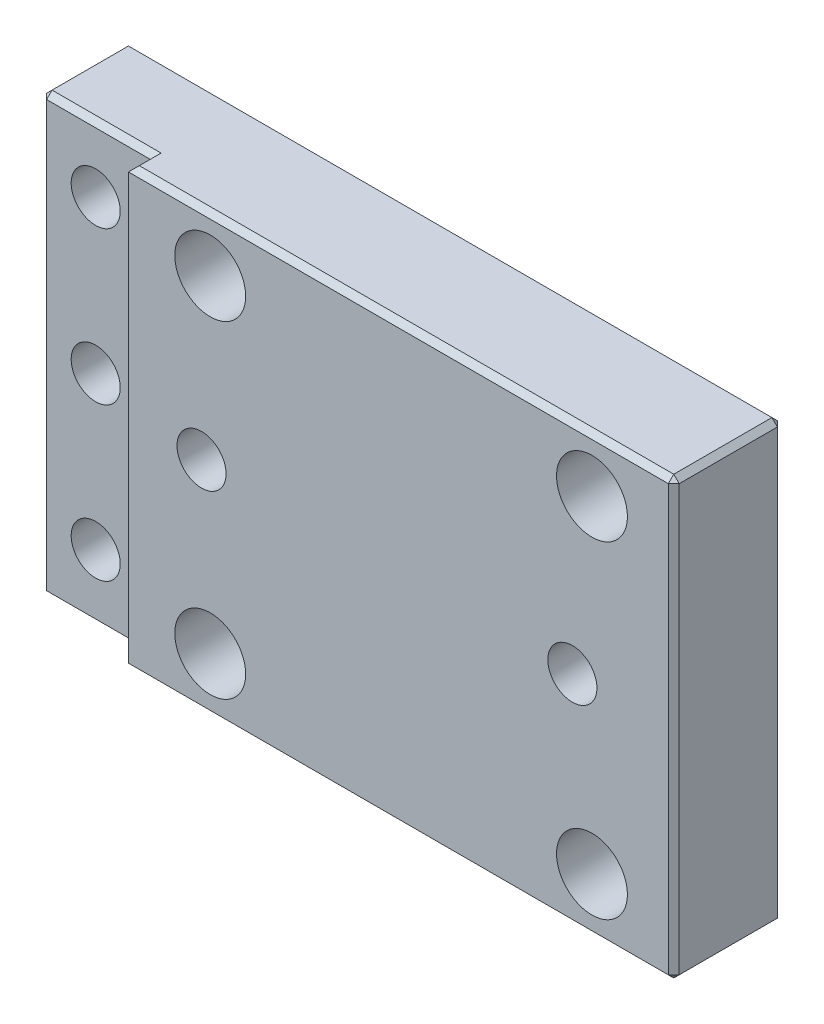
ISO-10303-21;
HEADER;
FILE_DESCRIPTION(('STEP AP214'),'2;1');
FILE_NAME('part.step','',(''),(''),'','','');
FILE_SCHEMA(('AUTOMOTIVE_DESIGN { 1 0 10303 214 1 1 1 1 }'));
ENDSEC;
DATA;
#1=APPLICATION_CONTEXT('core data for automotive mechanical design processes');
#2=APPLICATION_PROTOCOL_DEFINITION('international standard','automotive_design',2000,#1);
#3=PRODUCT_CONTEXT('',#1,'mechanical');
#4=PRODUCT('Part','Part','',(#3));
#5=PRODUCT_RELATED_PRODUCT_CATEGORY('part','',(#4));
#6=PRODUCT_DEFINITION_FORMATION('','',#4);
#7=PRODUCT_DEFINITION_CONTEXT('part definition',#1,'design');
#8=PRODUCT_DEFINITION('design','',#6,#7);
#9=PRODUCT_DEFINITION_SHAPE('','',#8);
#10=(LENGTH_UNIT() NAMED_UNIT(*) SI_UNIT(.MILLI.,.METRE.));
#11=(NAMED_UNIT(*) PLANE_ANGLE_UNIT() SI_UNIT($,.RADIAN.));
#12=(NAMED_UNIT(*) SI_UNIT($,.STERADIAN.) SOLID_ANGLE_UNIT());
#13=UNCERTAINTY_MEASURE_WITH_UNIT(LENGTH_MEASURE(1.E-05),#10,'distance_accuracy_value','');
#14=(GEOMETRIC_REPRESENTATION_CONTEXT(3) GLOBAL_UNCERTAINTY_ASSIGNED_CONTEXT((#13)) GLOBAL_UNIT_ASSIGNED_CONTEXT((#10,
#11,#12)) REPRESENTATION_CONTEXT('',''));
#15=CARTESIAN_POINT('',(0.,0.,0.));
#16=DIRECTION('',(0.,0.,1.));
#17=DIRECTION('',(1.,0.,0.));
#18=AXIS2_PLACEMENT_3D('',#15,#16,#17);
#19=CARTESIAN_POINT('',(30.,20.,10.));
#20=DIRECTION('',(-1.,0.,0.));
#21=DIRECTION('',(0.,-1.,0.));
#22=AXIS2_PLACEMENT_3D('',#19,#20,#21);
#23=PLANE('',#22);
#24=DIRECTION('',(0.,-1.,0.));
#25=VECTOR('',#24,1.);
#26=CARTESIAN_POINT('',(30.,-20.,9.5));
#27=LINE('',#26,#25);
#28=CARTESIAN_POINT('',(30.,19.5,9.5));
#29=VERTEX_POINT('',#28);
#30=CARTESIAN_POINT('',(30.,-19.5,9.5));
#31=VERTEX_POINT('',#30);
#32=EDGE_CURVE('E25',#29,#31,#27,.T.);
#33=ORIENTED_EDGE('',*,*,#32,.T.);
#34=DIRECTION('',(0.,0.,-1.));
#35=VECTOR('',#34,1.);
#36=CARTESIAN_POINT('',(30.,-19.5,10.));
#37=LINE('',#36,#35);
#38=CARTESIAN_POINT('',(30.,-19.5,0.500000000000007));
#39=VERTEX_POINT('',#38);
#40=EDGE_CURVE('E11',#31,#39,#37,.T.);
#41=ORIENTED_EDGE('',*,*,#40,.T.);
#42=DIRECTION('',(0.,1.,0.));
#43=VECTOR('',#42,1.);
#44=CARTESIAN_POINT('',(30.,20.,0.500000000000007));
#45=LINE('',#44,#43);
#46=CARTESIAN_POINT('',(30.,19.5,0.500000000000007));
#47=VERTEX_POINT('',#46);
#48=EDGE_CURVE('E224',#39,#47,#45,.T.);
#49=ORIENTED_EDGE('',*,*,#48,.T.);
#50=DIRECTION('',(0.,0.,1.));
#51=VECTOR('',#50,1.);
#52=CARTESIAN_POINT('',(30.,19.5,10.));
#53=LINE('',#52,#51);
#54=EDGE_CURVE('E36',#47,#29,#53,.T.);
#55=ORIENTED_EDGE('',*,*,#54,.T.);
#56=EDGE_LOOP('',(#33,#41,#49,#55));
#57=FACE_BOUND('',#56,.T.);
#58=ADVANCED_FACE('F16',(#57),#23,.F.);
#59=CARTESIAN_POINT('',(-30.,20.,10.));
#60=DIRECTION('',(0.,-1.,0.));
#61=DIRECTION('',(0.,0.,-1.));
#62=AXIS2_PLACEMENT_3D('',#59,#60,#61);
#63=PLANE('',#62);
#64=DIRECTION('',(-1.,0.,0.));
#65=VECTOR('',#64,1.);
#66=CARTESIAN_POINT('',(-30.,20.,0.500000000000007));
#67=LINE('',#66,#65);
#68=CARTESIAN_POINT('',(29.5,20.,0.500000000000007));
#69=VERTEX_POINT('',#68);
#70=CARTESIAN_POINT('',(-29.5,20.,0.500000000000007));
#71=VERTEX_POINT('',#70);
#72=EDGE_CURVE('E219',#69,#71,#67,.T.);
#73=ORIENTED_EDGE('',*,*,#72,.T.);
#74=DIRECTION('',(0.,0.,1.));
#75=VECTOR('',#74,1.);
#76=CARTESIAN_POINT('',(-29.5,20.,10.));
#77=LINE('',#76,#75);
#78=CARTESIAN_POINT('',(-29.5,20.,7.5));
#79=VERTEX_POINT('',#78);
#80=EDGE_CURVE('E221',#71,#79,#77,.T.);
#81=ORIENTED_EDGE('',*,*,#80,.T.);
#82=DIRECTION('',(1.,0.,0.));
#83=VECTOR('',#82,1.);
#84=CARTESIAN_POINT('',(-30.,20.,7.5));
#85=LINE('',#84,#83);
#86=CARTESIAN_POINT('',(-19.5,20.,7.5));
#87=VERTEX_POINT('',#86);
#88=EDGE_CURVE('E217',#79,#87,#85,.T.);
#89=ORIENTED_EDGE('',*,*,#88,.T.);
#90=DIRECTION('',(0.,0.,1.));
#91=VECTOR('',#90,1.);
#92=CARTESIAN_POINT('',(-19.5,20.,10.));
#93=LINE('',#92,#91);
#94=CARTESIAN_POINT('',(-19.5,20.,9.5));
#95=VERTEX_POINT('',#94);
#96=EDGE_CURVE('E157',#87,#95,#93,.T.);
#97=ORIENTED_EDGE('',*,*,#96,.T.);
#98=DIRECTION('',(1.,0.,0.));
#99=VECTOR('',#98,1.);
#100=CARTESIAN_POINT('',(30.,20.,9.5));
#101=LINE('',#100,#99);
#102=CARTESIAN_POINT('',(29.5,20.,9.5));
#103=VERTEX_POINT('',#102);
#104=EDGE_CURVE('E214',#95,#103,#101,.T.);
#105=ORIENTED_EDGE('',*,*,#104,.T.);
#106=DIRECTION('',(0.,0.,-1.));
#107=VECTOR('',#106,1.);
#108=CARTESIAN_POINT('',(29.5,20.,10.));
#109=LINE('',#108,#107);
#110=EDGE_CURVE('E212',#103,#69,#109,.T.);
#111=ORIENTED_EDGE('',*,*,#110,.T.);
#112=EDGE_LOOP('',(#73,#81,#89,#97,#105,#111));
#113=FACE_BOUND('',#112,.T.);
#114=ADVANCED_FACE('F410',(#113),#63,.F.);
#115=CARTESIAN_POINT('',(-30.,20.,10.));
#116=DIRECTION('',(1.,0.,0.));
#117=DIRECTION('',(0.,1.,0.));
#118=AXIS2_PLACEMENT_3D('',#115,#116,#117);
#119=PLANE('',#118);
#120=DIRECTION('',(0.,0.,-1.));
#121=VECTOR('',#120,1.);
#122=CARTESIAN_POINT('',(-30.,19.5,10.));
#123=LINE('',#122,#121);
#124=CARTESIAN_POINT('',(-30.,19.5,7.5));
#125=VERTEX_POINT('',#124);
#126=CARTESIAN_POINT('',(-30.,19.5,0.500000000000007));
#127=VERTEX_POINT('',#126);
#128=EDGE_CURVE('E203',#125,#127,#123,.T.);
#129=ORIENTED_EDGE('',*,*,#128,.T.);
#130=DIRECTION('',(0.,-1.,0.));
#131=VECTOR('',#130,1.);
#132=CARTESIAN_POINT('',(-30.,20.,0.500000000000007));
#133=LINE('',#132,#131);
#134=CARTESIAN_POINT('',(-30.,-19.5,0.500000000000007));
#135=VERTEX_POINT('',#134);
#136=EDGE_CURVE('E209',#127,#135,#133,.T.);
#137=ORIENTED_EDGE('',*,*,#136,.T.);
#138=DIRECTION('',(0.,0.,1.));
#139=VECTOR('',#138,1.);
#140=CARTESIAN_POINT('',(-30.,-19.5,10.));
#141=LINE('',#140,#139);
#142=CARTESIAN_POINT('',(-30.,-19.5,7.5));
#143=VERTEX_POINT('',#142);
#144=EDGE_CURVE('E207',#135,#143,#141,.T.);
#145=ORIENTED_EDGE('',*,*,#144,.T.);
#146=DIRECTION('',(0.,1.,0.));
#147=VECTOR('',#146,1.);
#148=CARTESIAN_POINT('',(-30.,20.,7.5));
#149=LINE('',#148,#147);
#150=EDGE_CURVE('E205',#143,#125,#149,.T.);
#151=ORIENTED_EDGE('',*,*,#150,.T.);
#152=EDGE_LOOP('',(#129,#137,#145,#151));
#153=FACE_BOUND('',#152,.T.);
#154=ADVANCED_FACE('F404',(#153),#119,.F.);
#155=CARTESIAN_POINT('',(-30.,-20.,10.));
#156=DIRECTION('',(0.,1.,0.));
#157=DIRECTION('',(0.,0.,1.));
#158=AXIS2_PLACEMENT_3D('',#155,#156,#157);
#159=PLANE('',#158);
#160=DIRECTION('',(-1.,0.,0.));
#161=VECTOR('',#160,1.);
#162=CARTESIAN_POINT('',(-30.,-20.,7.5));
#163=LINE('',#162,#161);
#164=CARTESIAN_POINT('',(-19.5,-20.,7.5));
#165=VERTEX_POINT('',#164);
#166=CARTESIAN_POINT('',(-29.5,-20.,7.5));
#167=VERTEX_POINT('',#166);
#168=EDGE_CURVE('E183',#165,#167,#163,.T.);
#169=ORIENTED_EDGE('',*,*,#168,.T.);
#170=DIRECTION('',(0.,0.,-1.));
#171=VECTOR('',#170,1.);
#172=CARTESIAN_POINT('',(-29.5,-20.,10.));
#173=LINE('',#172,#171);
#174=CARTESIAN_POINT('',(-29.5,-20.,0.500000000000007));
#175=VERTEX_POINT('',#174);
#176=EDGE_CURVE('E141',#167,#175,#173,.T.);
#177=ORIENTED_EDGE('',*,*,#176,.T.);
#178=DIRECTION('',(1.,0.,0.));
#179=VECTOR('',#178,1.);
#180=CARTESIAN_POINT('',(-30.,-20.,0.500000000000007));
#181=LINE('',#180,#179);
#182=CARTESIAN_POINT('',(29.5,-20.,0.500000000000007));
#183=VERTEX_POINT('',#182);
#184=EDGE_CURVE('E177',#175,#183,#181,.T.);
#185=ORIENTED_EDGE('',*,*,#184,.T.);
#186=DIRECTION('',(0.,0.,1.));
#187=VECTOR('',#186,1.);
#188=CARTESIAN_POINT('',(29.5,-20.,10.));
#189=LINE('',#188,#187);
#190=CARTESIAN_POINT('',(29.5,-20.,9.5));
#191=VERTEX_POINT('',#190);
#192=EDGE_CURVE('E175',#183,#191,#189,.T.);
#193=ORIENTED_EDGE('',*,*,#192,.T.);
#194=DIRECTION('',(-1.,0.,0.));
#195=VECTOR('',#194,1.);
#196=CARTESIAN_POINT('',(-20.,-20.,9.5));
#197=LINE('',#196,#195);
#198=CARTESIAN_POINT('',(-19.5,-20.,9.5));
#199=VERTEX_POINT('',#198);
#200=EDGE_CURVE('E179',#191,#199,#197,.T.);
#201=ORIENTED_EDGE('',*,*,#200,.T.);
#202=DIRECTION('',(0.,0.,-1.));
#203=VECTOR('',#202,1.);
#204=CARTESIAN_POINT('',(-19.5,-20.,10.));
#205=LINE('',#204,#203);
#206=EDGE_CURVE('E181',#199,#165,#205,.T.);
#207=ORIENTED_EDGE('',*,*,#206,.T.);
#208=EDGE_LOOP('',(#169,#177,#185,#193,#201,#207));
#209=FACE_BOUND('',#208,.T.);
#210=ADVANCED_FACE('F393',(#209),#159,.F.);
#211=CARTESIAN_POINT('',(0.,0.,10.));
#212=DIRECTION('',(0.,0.,1.));
#213=DIRECTION('',(1.,0.,0.));
#214=AXIS2_PLACEMENT_3D('',#211,#212,#213);
#215=PLANE('',#214);
#216=DIRECTION('',(0.,1.,0.));
#217=VECTOR('',#216,1.);
#218=CARTESIAN_POINT('',(-20.,0.,10.));
#219=LINE('',#218,#217);
#220=CARTESIAN_POINT('',(-20.,-19.5,10.));
#221=VERTEX_POINT('',#220);
#222=CARTESIAN_POINT('',(-20.,19.5,10.));
#223=VERTEX_POINT('',#222);
#224=EDGE_CURVE('E135',#221,#223,#219,.T.);
#225=ORIENTED_EDGE('',*,*,#224,.F.);
#226=DIRECTION('',(1.,0.,0.));
#227=VECTOR('',#226,1.);
#228=CARTESIAN_POINT('',(30.,-19.5,10.));
#229=LINE('',#228,#227);
#230=CARTESIAN_POINT('',(29.5,-19.5,10.));
#231=VERTEX_POINT('',#230);
#232=EDGE_CURVE('E192',#221,#231,#229,.T.);
#233=ORIENTED_EDGE('',*,*,#232,.T.);
#234=DIRECTION('',(0.,1.,0.));
#235=VECTOR('',#234,1.);
#236=CARTESIAN_POINT('',(29.5,20.,10.));
#237=LINE('',#236,#235);
#238=CARTESIAN_POINT('',(29.5,19.5,10.));
#239=VERTEX_POINT('',#238);
#240=EDGE_CURVE('E188',#231,#239,#237,.T.);
#241=ORIENTED_EDGE('',*,*,#240,.T.);
#242=DIRECTION('',(-1.,0.,0.));
#243=VECTOR('',#242,1.);
#244=CARTESIAN_POINT('',(-20.,19.5,10.));
#245=LINE('',#244,#243);
#246=EDGE_CURVE('E190',#239,#223,#245,.T.);
#247=ORIENTED_EDGE('',*,*,#246,.T.);
#248=EDGE_LOOP('',(#225,#233,#241,#247));
#249=FACE_BOUND('',#248,.T.);
#250=CARTESIAN_POINT('',(22.5,-15.,10.));
#251=DIRECTION('',(0.,0.,1.));
#252=DIRECTION('',(1.,0.,0.));
#253=AXIS2_PLACEMENT_3D('',#250,#251,#252);
#254=CIRCLE('',#253,3.25);
#255=CARTESIAN_POINT('',(25.75,-15.,10.));
#256=VERTEX_POINT('',#255);
#257=EDGE_CURVE('E300',#256,#256,#254,.T.);
#258=ORIENTED_EDGE('',*,*,#257,.F.);
#259=EDGE_LOOP('',(#258));
#260=FACE_BOUND('',#259,.T.);
#261=CARTESIAN_POINT('',(-12.5,-15.,10.));
#262=DIRECTION('',(0.,0.,1.));
#263=DIRECTION('',(1.,0.,0.));
#264=AXIS2_PLACEMENT_3D('',#261,#262,#263);
#265=CIRCLE('',#264,3.25);
#266=CARTESIAN_POINT('',(-9.25,-15.,10.));
#267=VERTEX_POINT('',#266);
#268=EDGE_CURVE('E311',#267,#267,#265,.T.);
#269=ORIENTED_EDGE('',*,*,#268,.F.);
#270=EDGE_LOOP('',(#269));
#271=FACE_BOUND('',#270,.T.);
#272=CARTESIAN_POINT('',(-12.5,15.,10.));
#273=DIRECTION('',(0.,0.,1.));
#274=DIRECTION('',(1.,0.,0.));
#275=AXIS2_PLACEMENT_3D('',#272,#273,#274);
#276=CIRCLE('',#275,3.25);
#277=CARTESIAN_POINT('',(-9.25,15.,10.));
#278=VERTEX_POINT('',#277);
#279=EDGE_CURVE('E319',#278,#278,#276,.T.);
#280=ORIENTED_EDGE('',*,*,#279,.F.);
#281=EDGE_LOOP('',(#280));
#282=FACE_BOUND('',#281,.T.);
#283=CARTESIAN_POINT('',(22.5,15.,10.));
#284=DIRECTION('',(0.,0.,1.));
#285=DIRECTION('',(1.,0.,0.));
#286=AXIS2_PLACEMENT_3D('',#283,#284,#285);
#287=CIRCLE('',#286,3.25);
#288=CARTESIAN_POINT('',(25.75,15.,10.));
#289=VERTEX_POINT('',#288);
#290=EDGE_CURVE('E325',#289,#289,#287,.T.);
#291=ORIENTED_EDGE('',*,*,#290,.F.);
#292=EDGE_LOOP('',(#291));
#293=FACE_BOUND('',#292,.T.);
#294=CARTESIAN_POINT('',(20.7036288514,0.,10.));
#295=DIRECTION('',(0.,0.,1.));
#296=DIRECTION('',(1.,0.,0.));
#297=AXIS2_PLACEMENT_3D('',#294,#295,#296);
#298=CIRCLE('',#297,2.25);
#299=CARTESIAN_POINT('',(22.9536288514,0.,10.));
#300=VERTEX_POINT('',#299);
#301=EDGE_CURVE('E171',#300,#300,#298,.T.);
#302=ORIENTED_EDGE('',*,*,#301,.F.);
#303=EDGE_LOOP('',(#302));
#304=FACE_BOUND('',#303,.T.);
#305=CARTESIAN_POINT('',(-13.2963711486,0.,10.));
#306=DIRECTION('',(0.,0.,1.));
#307=DIRECTION('',(1.,0.,0.));
#308=AXIS2_PLACEMENT_3D('',#305,#306,#307);
#309=CIRCLE('',#308,2.25);
#310=CARTESIAN_POINT('',(-11.0463711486,0.,10.));
#311=VERTEX_POINT('',#310);
#312=EDGE_CURVE('E349',#311,#311,#309,.T.);
#313=ORIENTED_EDGE('',*,*,#312,.F.);
#314=EDGE_LOOP('',(#313));
#315=FACE_BOUND('',#314,.T.);
#316=ADVANCED_FACE('F390',(#249,#260,#271,#282,#293,#304,#315),#215,.T.);
#317=CARTESIAN_POINT('',(0.,0.,0.));
#318=DIRECTION('',(0.,0.,1.));
#319=DIRECTION('',(1.,0.,0.));
#320=AXIS2_PLACEMENT_3D('',#317,#318,#319);
#321=PLANE('',#320);
#322=DIRECTION('',(0.,-1.,0.));
#323=VECTOR('',#322,1.);
#324=CARTESIAN_POINT('',(29.5,0.,0.));
#325=LINE('',#324,#323);
#326=CARTESIAN_POINT('',(29.5,19.5,0.));
#327=VERTEX_POINT('',#326);
#328=CARTESIAN_POINT('',(29.5,-19.5,0.));
#329=VERTEX_POINT('',#328);
#330=EDGE_CURVE('E194',#327,#329,#325,.T.);
#331=ORIENTED_EDGE('',*,*,#330,.T.);
#332=DIRECTION('',(-1.,0.,0.));
#333=VECTOR('',#332,1.);
#334=CARTESIAN_POINT('',(0.,-19.5,0.));
#335=LINE('',#334,#333);
#336=CARTESIAN_POINT('',(-29.5,-19.5,0.));
#337=VERTEX_POINT('',#336);
#338=EDGE_CURVE('E200',#329,#337,#335,.T.);
#339=ORIENTED_EDGE('',*,*,#338,.T.);
#340=DIRECTION('',(0.,1.,0.));
#341=VECTOR('',#340,1.);
#342=CARTESIAN_POINT('',(-29.5,0.,0.));
#343=LINE('',#342,#341);
#344=CARTESIAN_POINT('',(-29.5,19.5,0.));
#345=VERTEX_POINT('',#344);
#346=EDGE_CURVE('E198',#337,#345,#343,.T.);
#347=ORIENTED_EDGE('',*,*,#346,.T.);
#348=DIRECTION('',(1.,0.,0.));
#349=VECTOR('',#348,1.);
#350=CARTESIAN_POINT('',(0.,19.5,0.));
#351=LINE('',#350,#349);
#352=EDGE_CURVE('E196',#345,#327,#351,.T.);
#353=ORIENTED_EDGE('',*,*,#352,.T.);
#354=EDGE_LOOP('',(#331,#339,#347,#353));
#355=FACE_BOUND('',#354,.T.);
#356=CARTESIAN_POINT('',(22.5,-15.,0.));
#357=DIRECTION('',(0.,0.,1.));
#358=DIRECTION('',(1.,0.,0.));
#359=AXIS2_PLACEMENT_3D('',#356,#357,#358);
#360=CIRCLE('',#359,3.25);
#361=CARTESIAN_POINT('',(25.75,-15.,0.));
#362=VERTEX_POINT('',#361);
#363=EDGE_CURVE('E306',#362,#362,#360,.T.);
#364=ORIENTED_EDGE('',*,*,#363,.T.);
#365=EDGE_LOOP('',(#364));
#366=FACE_BOUND('',#365,.T.);
#367=CARTESIAN_POINT('',(-12.5,-15.,0.));
#368=DIRECTION('',(0.,0.,1.));
#369=DIRECTION('',(1.,0.,0.));
#370=AXIS2_PLACEMENT_3D('',#367,#368,#369);
#371=CIRCLE('',#370,3.25);
#372=CARTESIAN_POINT('',(-9.25,-15.,0.));
#373=VERTEX_POINT('',#372);
#374=EDGE_CURVE('E316',#373,#373,#371,.T.);
#375=ORIENTED_EDGE('',*,*,#374,.T.);
#376=EDGE_LOOP('',(#375));
#377=FACE_BOUND('',#376,.T.);
#378=CARTESIAN_POINT('',(-12.5,15.,0.));
#379=DIRECTION('',(0.,0.,1.));
#380=DIRECTION('',(1.,0.,0.));
#381=AXIS2_PLACEMENT_3D('',#378,#379,#380);
#382=CIRCLE('',#381,3.25);
#383=CARTESIAN_POINT('',(-9.25,15.,0.));
#384=VERTEX_POINT('',#383);
#385=EDGE_CURVE('E322',#384,#384,#382,.T.);
#386=ORIENTED_EDGE('',*,*,#385,.T.);
#387=EDGE_LOOP('',(#386));
#388=FACE_BOUND('',#387,.T.);
#389=CARTESIAN_POINT('',(22.5,15.,0.));
#390=DIRECTION('',(0.,0.,1.));
#391=DIRECTION('',(1.,0.,0.));
#392=AXIS2_PLACEMENT_3D('',#389,#390,#391);
#393=CIRCLE('',#392,3.25);
#394=CARTESIAN_POINT('',(25.75,15.,0.));
#395=VERTEX_POINT('',#394);
#396=EDGE_CURVE('E328',#395,#395,#393,.T.);
#397=ORIENTED_EDGE('',*,*,#396,.T.);
#398=EDGE_LOOP('',(#397));
#399=FACE_BOUND('',#398,.T.);
#400=CARTESIAN_POINT('',(20.7036288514,0.,0.));
#401=DIRECTION('',(0.,0.,-1.));
#402=DIRECTION('',(-1.,0.,0.));
#403=AXIS2_PLACEMENT_3D('',#400,#401,#402);
#404=CIRCLE('',#403,4.);
#405=CARTESIAN_POINT('',(16.7036288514,0.,0.));
#406=VERTEX_POINT('',#405);
#407=EDGE_CURVE('E331',#406,#406,#404,.T.);
#408=ORIENTED_EDGE('',*,*,#407,.F.);
#409=EDGE_LOOP('',(#408));
#410=FACE_BOUND('',#409,.T.);
#411=CARTESIAN_POINT('',(-13.2963711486,0.,0.));
#412=DIRECTION('',(0.,0.,-1.));
#413=DIRECTION('',(-1.,0.,0.));
#414=AXIS2_PLACEMENT_3D('',#411,#412,#413);
#415=CIRCLE('',#414,4.);
#416=CARTESIAN_POINT('',(-17.2963711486,0.,0.));
#417=VERTEX_POINT('',#416);
#418=EDGE_CURVE('E340',#417,#417,#415,.T.);
#419=ORIENTED_EDGE('',*,*,#418,.F.);
#420=EDGE_LOOP('',(#419));
#421=FACE_BOUND('',#420,.T.);
#422=CARTESIAN_POINT('',(-25.,14.,0.));
#423=DIRECTION('',(0.,0.,-1.));
#424=DIRECTION('',(-1.,0.,0.));
#425=AXIS2_PLACEMENT_3D('',#422,#423,#424);
#426=CIRCLE('',#425,4.);
#427=CARTESIAN_POINT('',(-29.,14.,0.));
#428=VERTEX_POINT('',#427);
#429=EDGE_CURVE('E350',#428,#428,#426,.T.);
#430=ORIENTED_EDGE('',*,*,#429,.F.);
#431=EDGE_LOOP('',(#430));
#432=FACE_BOUND('',#431,.T.);
#433=CARTESIAN_POINT('',(-25.,0.,0.));
#434=DIRECTION('',(0.,0.,-1.));
#435=DIRECTION('',(-1.,0.,0.));
#436=AXIS2_PLACEMENT_3D('',#433,#434,#435);
#437=CIRCLE('',#436,4.);
#438=CARTESIAN_POINT('',(-29.,0.,0.));
#439=VERTEX_POINT('',#438);
#440=EDGE_CURVE('E360',#439,#439,#437,.T.);
#441=ORIENTED_EDGE('',*,*,#440,.F.);
#442=EDGE_LOOP('',(#441));
#443=FACE_BOUND('',#442,.T.);
#444=CARTESIAN_POINT('',(-25.,-14.,0.));
#445=DIRECTION('',(0.,0.,-1.));
#446=DIRECTION('',(-1.,0.,0.));
#447=AXIS2_PLACEMENT_3D('',#444,#445,#446);
#448=CIRCLE('',#447,4.);
#449=CARTESIAN_POINT('',(-29.,-14.,0.));
#450=VERTEX_POINT('',#449);
#451=EDGE_CURVE('E370',#450,#450,#448,.T.);
#452=ORIENTED_EDGE('',*,*,#451,.F.);
#453=EDGE_LOOP('',(#452));
#454=FACE_BOUND('',#453,.T.);
#455=ADVANCED_FACE('F392',(#355,#366,#377,#388,#399,#410,#421,#432,#443,#454),#321,.F.);
#456=CARTESIAN_POINT('',(-20.,20.,8.));
#457=DIRECTION('',(0.,0.,-1.));
#458=DIRECTION('',(-1.,0.,0.));
#459=AXIS2_PLACEMENT_3D('',#456,#457,#458);
#460=PLANE('',#459);
#461=CARTESIAN_POINT('',(-25.,14.,8.));
#462=DIRECTION('',(0.,0.,-1.));
#463=DIRECTION('',(-1.,0.,0.));
#464=AXIS2_PLACEMENT_3D('',#461,#462,#463);
#465=CIRCLE('',#464,2.25);
#466=CARTESIAN_POINT('',(-27.25,14.,8.));
#467=VERTEX_POINT('',#466);
#468=EDGE_CURVE('E359',#467,#467,#465,.T.);
#469=ORIENTED_EDGE('',*,*,#468,.T.);
#470=EDGE_LOOP('',(#469));
#471=FACE_BOUND('',#470,.T.);
#472=CARTESIAN_POINT('',(-25.,0.,8.));
#473=DIRECTION('',(0.,0.,-1.));
#474=DIRECTION('',(-1.,0.,0.));
#475=AXIS2_PLACEMENT_3D('',#472,#473,#474);
#476=CIRCLE('',#475,2.25);
#477=CARTESIAN_POINT('',(-27.25,0.,8.));
#478=VERTEX_POINT('',#477);
#479=EDGE_CURVE('E369',#478,#478,#476,.T.);
#480=ORIENTED_EDGE('',*,*,#479,.T.);
#481=EDGE_LOOP('',(#480));
#482=FACE_BOUND('',#481,.T.);
#483=CARTESIAN_POINT('',(-25.,-14.,8.));
#484=DIRECTION('',(0.,0.,-1.));
#485=DIRECTION('',(-1.,0.,0.));
#486=AXIS2_PLACEMENT_3D('',#483,#484,#485);
#487=CIRCLE('',#486,2.25);
#488=CARTESIAN_POINT('',(-27.25,-14.,8.));
#489=VERTEX_POINT('',#488);
#490=EDGE_CURVE('E151',#489,#489,#487,.T.);
#491=ORIENTED_EDGE('',*,*,#490,.T.);
#492=EDGE_LOOP('',(#491));
#493=FACE_BOUND('',#492,.T.);
#494=DIRECTION('',(0.,-1.,0.));
#495=VECTOR('',#494,1.);
#496=CARTESIAN_POINT('',(-29.5,20.,8.));
#497=LINE('',#496,#495);
#498=CARTESIAN_POINT('',(-29.5,19.5,8.));
#499=VERTEX_POINT('',#498);
#500=CARTESIAN_POINT('',(-29.5,-19.5,8.));
#501=VERTEX_POINT('',#500);
#502=EDGE_CURVE('E166',#499,#501,#497,.T.);
#503=ORIENTED_EDGE('',*,*,#502,.T.);
#504=DIRECTION('',(1.,0.,0.));
#505=VECTOR('',#504,1.);
#506=CARTESIAN_POINT('',(-20.,-19.5,8.));
#507=LINE('',#506,#505);
#508=CARTESIAN_POINT('',(-20.,-19.5,8.));
#509=VERTEX_POINT('',#508);
#510=EDGE_CURVE('E150',#501,#509,#507,.T.);
#511=ORIENTED_EDGE('',*,*,#510,.T.);
#512=DIRECTION('',(0.,-1.,0.));
#513=VECTOR('',#512,1.);
#514=CARTESIAN_POINT('',(-20.,20.,8.));
#515=LINE('',#514,#513);
#516=CARTESIAN_POINT('',(-20.,19.5,8.));
#517=VERTEX_POINT('',#516);
#518=EDGE_CURVE('E133',#517,#509,#515,.T.);
#519=ORIENTED_EDGE('',*,*,#518,.F.);
#520=DIRECTION('',(-1.,0.,0.));
#521=VECTOR('',#520,1.);
#522=CARTESIAN_POINT('',(-20.,19.5,8.));
#523=LINE('',#522,#521);
#524=EDGE_CURVE('E147',#517,#499,#523,.T.);
#525=ORIENTED_EDGE('',*,*,#524,.T.);
#526=EDGE_LOOP('',(#503,#511,#519,#525));
#527=FACE_BOUND('',#526,.T.);
#528=ADVANCED_FACE('F145',(#471,#482,#493,#527),#460,.F.);
#529=CARTESIAN_POINT('',(-20.,20.,8.));
#530=DIRECTION('',(1.,0.,0.));
#531=DIRECTION('',(0.,0.,-1.));
#532=AXIS2_PLACEMENT_3D('',#529,#530,#531);
#533=PLANE('',#532);
#534=ORIENTED_EDGE('',*,*,#518,.T.);
#535=DIRECTION('',(0.,0.,1.));
#536=VECTOR('',#535,1.);
#537=CARTESIAN_POINT('',(-20.,-19.5,8.));
#538=LINE('',#537,#536);
#539=EDGE_CURVE('E140',#509,#221,#538,.T.);
#540=ORIENTED_EDGE('',*,*,#539,.T.);
#541=ORIENTED_EDGE('',*,*,#224,.T.);
#542=DIRECTION('',(0.,0.,-1.));
#543=VECTOR('',#542,1.);
#544=CARTESIAN_POINT('',(-20.,19.5,8.));
#545=LINE('',#544,#543);
#546=EDGE_CURVE('E130',#223,#517,#545,.T.);
#547=ORIENTED_EDGE('',*,*,#546,.T.);
#548=EDGE_LOOP('',(#534,#540,#541,#547));
#549=FACE_BOUND('',#548,.T.);
#550=ADVANCED_FACE('F132',(#549),#533,.F.);
#551=CARTESIAN_POINT('',(-25.,-14.,0.));
#552=DIRECTION('',(0.,0.,-1.));
#553=DIRECTION('',(-1.,0.,0.));
#554=AXIS2_PLACEMENT_3D('',#551,#552,#553);
#555=CYLINDRICAL_SURFACE('',#554,2.25);
#556=CARTESIAN_POINT('',(-25.,-14.,4.4));
#557=DIRECTION('',(0.,0.,-1.));
#558=DIRECTION('',(-1.,0.,0.));
#559=AXIS2_PLACEMENT_3D('',#556,#557,#558);
#560=CIRCLE('',#559,2.25);
#561=CARTESIAN_POINT('',(-27.25,-14.,4.4));
#562=VERTEX_POINT('',#561);
#563=EDGE_CURVE('E376',#562,#562,#560,.T.);
#564=ORIENTED_EDGE('',*,*,#563,.T.);
#565=EDGE_LOOP('',(#564));
#566=FACE_BOUND('',#565,.T.);
#567=ORIENTED_EDGE('',*,*,#490,.F.);
#568=EDGE_LOOP('',(#567));
#569=FACE_BOUND('',#568,.T.);
#570=ADVANCED_FACE('F603',(#566,#569),#555,.F.);
#571=CARTESIAN_POINT('',(-22.75,-14.,4.4));
#572=DIRECTION('',(0.,0.,1.));
#573=DIRECTION('',(1.,0.,0.));
#574=AXIS2_PLACEMENT_3D('',#571,#572,#573);
#575=PLANE('',#574);
#576=ORIENTED_EDGE('',*,*,#563,.F.);
#577=EDGE_LOOP('',(#576));
#578=FACE_BOUND('',#577,.T.);
#579=CARTESIAN_POINT('',(-25.,-14.,4.4));
#580=DIRECTION('',(0.,0.,-1.));
#581=DIRECTION('',(-1.,0.,0.));
#582=AXIS2_PLACEMENT_3D('',#579,#580,#581);
#583=CIRCLE('',#582,4.);
#584=CARTESIAN_POINT('',(-29.,-14.,4.4));
#585=VERTEX_POINT('',#584);
#586=EDGE_CURVE('E373',#585,#585,#583,.T.);
#587=ORIENTED_EDGE('',*,*,#586,.T.);
#588=EDGE_LOOP('',(#587));
#589=FACE_BOUND('',#588,.T.);
#590=ADVANCED_FACE('F612',(#578,#589),#575,.F.);
#591=CARTESIAN_POINT('',(-25.,-14.,0.));
#592=DIRECTION('',(0.,0.,-1.));
#593=DIRECTION('',(-1.,0.,0.));
#594=AXIS2_PLACEMENT_3D('',#591,#592,#593);
#595=CYLINDRICAL_SURFACE('',#594,4.);
#596=ORIENTED_EDGE('',*,*,#586,.F.);
#597=EDGE_LOOP('',(#596));
#598=FACE_BOUND('',#597,.T.);
#599=ORIENTED_EDGE('',*,*,#451,.T.);
#600=EDGE_LOOP('',(#599));
#601=FACE_BOUND('',#600,.T.);
#602=ADVANCED_FACE('F622',(#598,#601),#595,.F.);
#603=CARTESIAN_POINT('',(-25.,0.,0.));
#604=DIRECTION('',(0.,0.,-1.));
#605=DIRECTION('',(-1.,0.,0.));
#606=AXIS2_PLACEMENT_3D('',#603,#604,#605);
#607=CYLINDRICAL_SURFACE('',#606,2.25);
#608=CARTESIAN_POINT('',(-25.,0.,4.4));
#609=DIRECTION('',(0.,0.,-1.));
#610=DIRECTION('',(-1.,0.,0.));
#611=AXIS2_PLACEMENT_3D('',#608,#609,#610);
#612=CIRCLE('',#611,2.25);
#613=CARTESIAN_POINT('',(-27.25,0.,4.4));
#614=VERTEX_POINT('',#613);
#615=EDGE_CURVE('E366',#614,#614,#612,.T.);
#616=ORIENTED_EDGE('',*,*,#615,.T.);
#617=EDGE_LOOP('',(#616));
#618=FACE_BOUND('',#617,.T.);
#619=ORIENTED_EDGE('',*,*,#479,.F.);
#620=EDGE_LOOP('',(#619));
#621=FACE_BOUND('',#620,.T.);
#622=ADVANCED_FACE('F632',(#618,#621),#607,.F.);
#623=CARTESIAN_POINT('',(-22.75,0.,4.4));
#624=DIRECTION('',(0.,0.,1.));
#625=DIRECTION('',(1.,0.,0.));
#626=AXIS2_PLACEMENT_3D('',#623,#624,#625);
#627=PLANE('',#626);
#628=ORIENTED_EDGE('',*,*,#615,.F.);
#629=EDGE_LOOP('',(#628));
#630=FACE_BOUND('',#629,.T.);
#631=CARTESIAN_POINT('',(-25.,0.,4.4));
#632=DIRECTION('',(0.,0.,-1.));
#633=DIRECTION('',(-1.,0.,0.));
#634=AXIS2_PLACEMENT_3D('',#631,#632,#633);
#635=CIRCLE('',#634,4.);
#636=CARTESIAN_POINT('',(-29.,0.,4.4));
#637=VERTEX_POINT('',#636);
#638=EDGE_CURVE('E363',#637,#637,#635,.T.);
#639=ORIENTED_EDGE('',*,*,#638,.T.);
#640=EDGE_LOOP('',(#639));
#641=FACE_BOUND('',#640,.T.);
#642=ADVANCED_FACE('F642',(#630,#641),#627,.F.);
#643=CARTESIAN_POINT('',(-25.,0.,0.));
#644=DIRECTION('',(0.,0.,-1.));
#645=DIRECTION('',(-1.,0.,0.));
#646=AXIS2_PLACEMENT_3D('',#643,#644,#645);
#647=CYLINDRICAL_SURFACE('',#646,4.);
#648=ORIENTED_EDGE('',*,*,#638,.F.);
#649=EDGE_LOOP('',(#648));
#650=FACE_BOUND('',#649,.T.);
#651=ORIENTED_EDGE('',*,*,#440,.T.);
#652=EDGE_LOOP('',(#651));
#653=FACE_BOUND('',#652,.T.);
#654=ADVANCED_FACE('F652',(#650,#653),#647,.F.);
#655=CARTESIAN_POINT('',(-25.,14.,0.));
#656=DIRECTION('',(0.,0.,-1.));
#657=DIRECTION('',(-1.,0.,0.));
#658=AXIS2_PLACEMENT_3D('',#655,#656,#657);
#659=CYLINDRICAL_SURFACE('',#658,2.25);
#660=CARTESIAN_POINT('',(-25.,14.,4.4));
#661=DIRECTION('',(0.,0.,-1.));
#662=DIRECTION('',(-1.,0.,0.));
#663=AXIS2_PLACEMENT_3D('',#660,#661,#662);
#664=CIRCLE('',#663,2.25);
#665=CARTESIAN_POINT('',(-27.25,14.,4.4));
#666=VERTEX_POINT('',#665);
#667=EDGE_CURVE('E356',#666,#666,#664,.T.);
#668=ORIENTED_EDGE('',*,*,#667,.T.);
#669=EDGE_LOOP('',(#668));
#670=FACE_BOUND('',#669,.T.);
#671=ORIENTED_EDGE('',*,*,#468,.F.);
#672=EDGE_LOOP('',(#671));
#673=FACE_BOUND('',#672,.T.);
#674=ADVANCED_FACE('F662',(#670,#673),#659,.F.);
#675=CARTESIAN_POINT('',(-22.75,14.,4.4));
#676=DIRECTION('',(0.,0.,1.));
#677=DIRECTION('',(1.,0.,0.));
#678=AXIS2_PLACEMENT_3D('',#675,#676,#677);
#679=PLANE('',#678);
#680=ORIENTED_EDGE('',*,*,#667,.F.);
#681=EDGE_LOOP('',(#680));
#682=FACE_BOUND('',#681,.T.);
#683=CARTESIAN_POINT('',(-25.,14.,4.4));
#684=DIRECTION('',(0.,0.,-1.));
#685=DIRECTION('',(-1.,0.,0.));
#686=AXIS2_PLACEMENT_3D('',#683,#684,#685);
#687=CIRCLE('',#686,4.);
#688=CARTESIAN_POINT('',(-29.,14.,4.4));
#689=VERTEX_POINT('',#688);
#690=EDGE_CURVE('E353',#689,#689,#687,.T.);
#691=ORIENTED_EDGE('',*,*,#690,.T.);
#692=EDGE_LOOP('',(#691));
#693=FACE_BOUND('',#692,.T.);
#694=ADVANCED_FACE('F672',(#682,#693),#679,.F.);
#695=CARTESIAN_POINT('',(-25.,14.,0.));
#696=DIRECTION('',(0.,0.,-1.));
#697=DIRECTION('',(-1.,0.,0.));
#698=AXIS2_PLACEMENT_3D('',#695,#696,#697);
#699=CYLINDRICAL_SURFACE('',#698,4.);
#700=ORIENTED_EDGE('',*,*,#690,.F.);
#701=EDGE_LOOP('',(#700));
#702=FACE_BOUND('',#701,.T.);
#703=ORIENTED_EDGE('',*,*,#429,.T.);
#704=EDGE_LOOP('',(#703));
#705=FACE_BOUND('',#704,.T.);
#706=ADVANCED_FACE('F682',(#702,#705),#699,.F.);
#707=CARTESIAN_POINT('',(-13.2963711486,0.,0.));
#708=DIRECTION('',(0.,0.,-1.));
#709=DIRECTION('',(-1.,0.,0.));
#710=AXIS2_PLACEMENT_3D('',#707,#708,#709);
#711=CYLINDRICAL_SURFACE('',#710,2.25);
#712=ORIENTED_EDGE('',*,*,#312,.T.);
#713=EDGE_LOOP('',(#712));
#714=FACE_BOUND('',#713,.T.);
#715=CARTESIAN_POINT('',(-13.2963711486,0.,4.4));
#716=DIRECTION('',(0.,0.,-1.));
#717=DIRECTION('',(-1.,0.,0.));
#718=AXIS2_PLACEMENT_3D('',#715,#716,#717);
#719=CIRCLE('',#718,2.25);
#720=CARTESIAN_POINT('',(-15.5463711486,0.,4.4));
#721=VERTEX_POINT('',#720);
#722=EDGE_CURVE('E346',#721,#721,#719,.T.);
#723=ORIENTED_EDGE('',*,*,#722,.T.);
#724=EDGE_LOOP('',(#723));
#725=FACE_BOUND('',#724,.T.);
#726=ADVANCED_FACE('F387',(#714,#725),#711,.F.);
#727=CARTESIAN_POINT('',(-11.0463711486,0.,4.4));
#728=DIRECTION('',(0.,0.,1.));
#729=DIRECTION('',(1.,0.,0.));
#730=AXIS2_PLACEMENT_3D('',#727,#728,#729);
#731=PLANE('',#730);
#732=ORIENTED_EDGE('',*,*,#722,.F.);
#733=EDGE_LOOP('',(#732));
#734=FACE_BOUND('',#733,.T.);
#735=CARTESIAN_POINT('',(-13.2963711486,0.,4.4));
#736=DIRECTION('',(0.,0.,-1.));
#737=DIRECTION('',(-1.,0.,0.));
#738=AXIS2_PLACEMENT_3D('',#735,#736,#737);
#739=CIRCLE('',#738,4.);
#740=CARTESIAN_POINT('',(-17.2963711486,0.,4.4));
#741=VERTEX_POINT('',#740);
#742=EDGE_CURVE('E343',#741,#741,#739,.T.);
#743=ORIENTED_EDGE('',*,*,#742,.T.);
#744=EDGE_LOOP('',(#743));
#745=FACE_BOUND('',#744,.T.);
#746=ADVANCED_FACE('F701',(#734,#745),#731,.F.);
#747=CARTESIAN_POINT('',(-13.2963711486,0.,0.));
#748=DIRECTION('',(0.,0.,-1.));
#749=DIRECTION('',(-1.,0.,0.));
#750=AXIS2_PLACEMENT_3D('',#747,#748,#749);
#751=CYLINDRICAL_SURFACE('',#750,4.);
#752=ORIENTED_EDGE('',*,*,#742,.F.);
#753=EDGE_LOOP('',(#752));
#754=FACE_BOUND('',#753,.T.);
#755=ORIENTED_EDGE('',*,*,#418,.T.);
#756=EDGE_LOOP('',(#755));
#757=FACE_BOUND('',#756,.T.);
#758=ADVANCED_FACE('F710',(#754,#757),#751,.F.);
#759=CARTESIAN_POINT('',(20.7036288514,0.,0.));
#760=DIRECTION('',(0.,0.,-1.));
#761=DIRECTION('',(-1.,0.,0.));
#762=AXIS2_PLACEMENT_3D('',#759,#760,#761);
#763=CYLINDRICAL_SURFACE('',#762,2.25);
#764=ORIENTED_EDGE('',*,*,#301,.T.);
#765=EDGE_LOOP('',(#764));
#766=FACE_BOUND('',#765,.T.);
#767=CARTESIAN_POINT('',(20.7036288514,0.,4.4));
#768=DIRECTION('',(0.,0.,-1.));
#769=DIRECTION('',(-1.,0.,0.));
#770=AXIS2_PLACEMENT_3D('',#767,#768,#769);
#771=CIRCLE('',#770,2.25);
#772=CARTESIAN_POINT('',(18.4536288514,0.,4.4));
#773=VERTEX_POINT('',#772);
#774=EDGE_CURVE('E337',#773,#773,#771,.T.);
#775=ORIENTED_EDGE('',*,*,#774,.T.);
#776=EDGE_LOOP('',(#775));
#777=FACE_BOUND('',#776,.T.);
#778=ADVANCED_FACE('F720',(#766,#777),#763,.F.);
#779=CARTESIAN_POINT('',(22.9536288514,0.,4.4));
#780=DIRECTION('',(0.,0.,1.));
#781=DIRECTION('',(1.,0.,0.));
#782=AXIS2_PLACEMENT_3D('',#779,#780,#781);
#783=PLANE('',#782);
#784=ORIENTED_EDGE('',*,*,#774,.F.);
#785=EDGE_LOOP('',(#784));
#786=FACE_BOUND('',#785,.T.);
#787=CARTESIAN_POINT('',(20.7036288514,0.,4.4));
#788=DIRECTION('',(0.,0.,-1.));
#789=DIRECTION('',(-1.,0.,0.));
#790=AXIS2_PLACEMENT_3D('',#787,#788,#789);
#791=CIRCLE('',#790,4.);
#792=CARTESIAN_POINT('',(16.7036288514,0.,4.4));
#793=VERTEX_POINT('',#792);
#794=EDGE_CURVE('E334',#793,#793,#791,.T.);
#795=ORIENTED_EDGE('',*,*,#794,.T.);
#796=EDGE_LOOP('',(#795));
#797=FACE_BOUND('',#796,.T.);
#798=ADVANCED_FACE('F730',(#786,#797),#783,.F.);
#799=CARTESIAN_POINT('',(20.7036288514,0.,0.));
#800=DIRECTION('',(0.,0.,-1.));
#801=DIRECTION('',(-1.,0.,0.));
#802=AXIS2_PLACEMENT_3D('',#799,#800,#801);
#803=CYLINDRICAL_SURFACE('',#802,4.);
#804=ORIENTED_EDGE('',*,*,#794,.F.);
#805=EDGE_LOOP('',(#804));
#806=FACE_BOUND('',#805,.T.);
#807=ORIENTED_EDGE('',*,*,#407,.T.);
#808=EDGE_LOOP('',(#807));
#809=FACE_BOUND('',#808,.T.);
#810=ADVANCED_FACE('F740',(#806,#809),#803,.F.);
#811=CARTESIAN_POINT('',(22.5,15.,10.));
#812=DIRECTION('',(0.,0.,1.));
#813=DIRECTION('',(1.,0.,0.));
#814=AXIS2_PLACEMENT_3D('',#811,#812,#813);
#815=CYLINDRICAL_SURFACE('',#814,3.25);
#816=ORIENTED_EDGE('',*,*,#396,.F.);
#817=EDGE_LOOP('',(#816));
#818=FACE_BOUND('',#817,.T.);
#819=ORIENTED_EDGE('',*,*,#290,.T.);
#820=EDGE_LOOP('',(#819));
#821=FACE_BOUND('',#820,.T.);
#822=ADVANCED_FACE('F750',(#818,#821),#815,.F.);
#823=CARTESIAN_POINT('',(-12.5,15.,10.));
#824=DIRECTION('',(0.,0.,1.));
#825=DIRECTION('',(1.,0.,0.));
#826=AXIS2_PLACEMENT_3D('',#823,#824,#825);
#827=CYLINDRICAL_SURFACE('',#826,3.25);
#828=ORIENTED_EDGE('',*,*,#385,.F.);
#829=EDGE_LOOP('',(#828));
#830=FACE_BOUND('',#829,.T.);
#831=ORIENTED_EDGE('',*,*,#279,.T.);
#832=EDGE_LOOP('',(#831));
#833=FACE_BOUND('',#832,.T.);
#834=ADVANCED_FACE('F760',(#830,#833),#827,.F.);
#835=CARTESIAN_POINT('',(-12.5,-15.,10.));
#836=DIRECTION('',(0.,0.,1.));
#837=DIRECTION('',(1.,0.,0.));
#838=AXIS2_PLACEMENT_3D('',#835,#836,#837);
#839=CYLINDRICAL_SURFACE('',#838,3.25);
#840=ORIENTED_EDGE('',*,*,#374,.F.);
#841=EDGE_LOOP('',(#840));
#842=FACE_BOUND('',#841,.T.);
#843=ORIENTED_EDGE('',*,*,#268,.T.);
#844=EDGE_LOOP('',(#843));
#845=FACE_BOUND('',#844,.T.);
#846=ADVANCED_FACE('F514',(#842,#845),#839,.F.);
#847=CARTESIAN_POINT('',(22.5,-15.,10.));
#848=DIRECTION('',(0.,0.,1.));
#849=DIRECTION('',(1.,0.,0.));
#850=AXIS2_PLACEMENT_3D('',#847,#848,#849);
#851=CYLINDRICAL_SURFACE('',#850,3.25);
#852=ORIENTED_EDGE('',*,*,#363,.F.);
#853=EDGE_LOOP('',(#852));
#854=FACE_BOUND('',#853,.T.);
#855=ORIENTED_EDGE('',*,*,#257,.T.);
#856=EDGE_LOOP('',(#855));
#857=FACE_BOUND('',#856,.T.);
#858=ADVANCED_FACE('F508',(#854,#857),#851,.F.);
#859=CARTESIAN_POINT('',(29.5,19.5,0.));
#860=DIRECTION('',(0.577350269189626,0.577350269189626,-0.577350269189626));
#861=DIRECTION('',(-0.707106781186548,0.,-0.707106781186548));
#862=AXIS2_PLACEMENT_3D('',#859,#860,#861);
#863=PLANE('',#862);
#864=DIRECTION('',(0.707106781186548,0.,0.707106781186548));
#865=VECTOR('',#864,1.);
#866=CARTESIAN_POINT('',(29.5,19.5,0.));
#867=LINE('',#866,#865);
#868=EDGE_CURVE('E291',#327,#47,#867,.T.);
#869=ORIENTED_EDGE('',*,*,#868,.F.);
#870=DIRECTION('',(0.,-0.707106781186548,-0.707106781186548));
#871=VECTOR('',#870,1.);
#872=CARTESIAN_POINT('',(29.5,19.5,0.));
#873=LINE('',#872,#871);
#874=EDGE_CURVE('E20',#69,#327,#873,.T.);
#875=ORIENTED_EDGE('',*,*,#874,.F.);
#876=DIRECTION('',(-0.707106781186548,0.707106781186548,0.));
#877=VECTOR('',#876,1.);
#878=CARTESIAN_POINT('',(29.75,19.75,0.500000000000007));
#879=LINE('',#878,#877);
#880=EDGE_CURVE('E293',#47,#69,#879,.T.);
#881=ORIENTED_EDGE('',*,*,#880,.F.);
#882=EDGE_LOOP('',(#869,#875,#881));
#883=FACE_BOUND('',#882,.T.);
#884=ADVANCED_FACE('F18',(#883),#863,.T.);
#885=CARTESIAN_POINT('',(-30.,20.,0.500000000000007));
#886=DIRECTION('',(0.,-0.707106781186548,0.707106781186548));
#887=DIRECTION('',(-1.,0.,0.));
#888=AXIS2_PLACEMENT_3D('',#885,#886,#887);
#889=PLANE('',#888);
#890=ORIENTED_EDGE('',*,*,#874,.T.);
#891=ORIENTED_EDGE('',*,*,#352,.F.);
#892=DIRECTION('',(0.,0.707106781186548,0.707106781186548));
#893=VECTOR('',#892,1.);
#894=CARTESIAN_POINT('',(-29.5,19.5,0.));
#895=LINE('',#894,#893);
#896=EDGE_CURVE('E288',#71,#345,#895,.F.);
#897=ORIENTED_EDGE('',*,*,#896,.F.);
#898=ORIENTED_EDGE('',*,*,#72,.F.);
#899=EDGE_LOOP('',(#890,#891,#897,#898));
#900=FACE_BOUND('',#899,.T.);
#901=ADVANCED_FACE('F501',(#900),#889,.F.);
#902=CARTESIAN_POINT('',(0.,19.5,10.));
#903=DIRECTION('',(0.,0.707106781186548,0.707106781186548));
#904=DIRECTION('',(1.,0.,0.));
#905=AXIS2_PLACEMENT_3D('',#902,#903,#904);
#906=PLANE('',#905);
#907=DIRECTION('',(0.,-0.707106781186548,0.707106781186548));
#908=VECTOR('',#907,1.);
#909=CARTESIAN_POINT('',(29.5,20.,9.5));
#910=LINE('',#909,#908);
#911=EDGE_CURVE('E283',#103,#239,#910,.T.);
#912=ORIENTED_EDGE('',*,*,#911,.F.);
#913=ORIENTED_EDGE('',*,*,#104,.F.);
#914=DIRECTION('',(0.577350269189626,0.577350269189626,-0.577350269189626));
#915=VECTOR('',#914,1.);
#916=CARTESIAN_POINT('',(-13.3333333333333,26.1666666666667,3.33333333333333));
#917=LINE('',#916,#915);
#918=EDGE_CURVE('E286',#223,#95,#917,.T.);
#919=ORIENTED_EDGE('',*,*,#918,.F.);
#920=ORIENTED_EDGE('',*,*,#246,.F.);
#921=EDGE_LOOP('',(#912,#913,#919,#920));
#922=FACE_BOUND('',#921,.T.);
#923=ADVANCED_FACE('F499',(#922),#906,.T.);
#924=CARTESIAN_POINT('',(29.5,20.,10.));
#925=DIRECTION('',(-0.707106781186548,-0.707106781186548,0.));
#926=DIRECTION('',(0.,0.,-1.));
#927=AXIS2_PLACEMENT_3D('',#924,#925,#926);
#928=PLANE('',#927);
#929=ORIENTED_EDGE('',*,*,#880,.T.);
#930=ORIENTED_EDGE('',*,*,#110,.F.);
#931=DIRECTION('',(0.707106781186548,-0.707106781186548,0.));
#932=VECTOR('',#931,1.);
#933=CARTESIAN_POINT('',(29.5,20.,9.5));
#934=LINE('',#933,#932);
#935=EDGE_CURVE('E280',#29,#103,#934,.F.);
#936=ORIENTED_EDGE('',*,*,#935,.F.);
#937=ORIENTED_EDGE('',*,*,#54,.F.);
#938=EDGE_LOOP('',(#929,#930,#936,#937));
#939=FACE_BOUND('',#938,.T.);
#940=ADVANCED_FACE('F495',(#939),#928,.F.);
#941=CARTESIAN_POINT('',(30.,20.,0.500000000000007));
#942=DIRECTION('',(-0.707106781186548,0.,0.707106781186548));
#943=DIRECTION('',(0.,1.,0.));
#944=AXIS2_PLACEMENT_3D('',#941,#942,#943);
#945=PLANE('',#944);
#946=ORIENTED_EDGE('',*,*,#868,.T.);
#947=ORIENTED_EDGE('',*,*,#48,.F.);
#948=DIRECTION('',(-0.707106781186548,0.,-0.707106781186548));
#949=VECTOR('',#948,1.);
#950=CARTESIAN_POINT('',(29.75,-19.5,0.250000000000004));
#951=LINE('',#950,#949);
#952=EDGE_CURVE('E277',#329,#39,#951,.F.);
#953=ORIENTED_EDGE('',*,*,#952,.F.);
#954=ORIENTED_EDGE('',*,*,#330,.F.);
#955=EDGE_LOOP('',(#946,#947,#953,#954));
#956=FACE_BOUND('',#955,.T.);
#957=ADVANCED_FACE('F491',(#956),#945,.F.);
#958=CARTESIAN_POINT('',(-29.5,19.5,0.));
#959=DIRECTION('',(-0.577350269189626,0.577350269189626,-0.577350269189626));
#960=DIRECTION('',(-0.707106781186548,0.,0.707106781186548));
#961=AXIS2_PLACEMENT_3D('',#958,#959,#960);
#962=PLANE('',#961);
#963=DIRECTION('',(-0.707106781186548,-0.707106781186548,0.));
#964=VECTOR('',#963,1.);
#965=CARTESIAN_POINT('',(-29.75,19.75,0.500000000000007));
#966=LINE('',#965,#964);
#967=EDGE_CURVE('E160',#71,#127,#966,.T.);
#968=ORIENTED_EDGE('',*,*,#967,.F.);
#969=ORIENTED_EDGE('',*,*,#896,.T.);
#970=DIRECTION('',(0.707106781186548,0.,-0.707106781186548));
#971=VECTOR('',#970,1.);
#972=CARTESIAN_POINT('',(-29.5,19.5,0.));
#973=LINE('',#972,#971);
#974=EDGE_CURVE('E271',#127,#345,#973,.T.);
#975=ORIENTED_EDGE('',*,*,#974,.F.);
#976=EDGE_LOOP('',(#968,#969,#975));
#977=FACE_BOUND('',#976,.T.);
#978=ADVANCED_FACE('F488',(#977),#962,.T.);
#979=CARTESIAN_POINT('',(-19.5,20.,10.));
#980=DIRECTION('',(0.707106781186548,-0.707106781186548,0.));
#981=DIRECTION('',(0.,0.,1.));
#982=AXIS2_PLACEMENT_3D('',#979,#980,#981);
#983=PLANE('',#982);
#984=ORIENTED_EDGE('',*,*,#918,.T.);
#985=ORIENTED_EDGE('',*,*,#96,.F.);
#986=DIRECTION('',(-0.577350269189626,-0.577350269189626,0.577350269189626));
#987=VECTOR('',#986,1.);
#988=CARTESIAN_POINT('',(-23.,16.5,11.));
#989=LINE('',#988,#987);
#990=EDGE_CURVE('E155',#517,#87,#989,.F.);
#991=ORIENTED_EDGE('',*,*,#990,.F.);
#992=ORIENTED_EDGE('',*,*,#546,.F.);
#993=EDGE_LOOP('',(#984,#985,#991,#992));
#994=FACE_BOUND('',#993,.T.);
#995=ADVANCED_FACE('F156',(#994),#983,.F.);
#996=CARTESIAN_POINT('',(29.5,20.,9.5));
#997=DIRECTION('',(0.577350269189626,0.577350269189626,0.577350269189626));
#998=DIRECTION('',(0.707106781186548,0.,-0.707106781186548));
#999=AXIS2_PLACEMENT_3D('',#996,#997,#998);
#1000=PLANE('',#999);
#1001=ORIENTED_EDGE('',*,*,#935,.T.);
#1002=ORIENTED_EDGE('',*,*,#911,.T.);
#1003=DIRECTION('',(0.707106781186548,0.,-0.707106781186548));
#1004=VECTOR('',#1003,1.);
#1005=CARTESIAN_POINT('',(29.75,19.5,9.75));
#1006=LINE('',#1005,#1004);
#1007=EDGE_CURVE('E161',#29,#239,#1006,.F.);
#1008=ORIENTED_EDGE('',*,*,#1007,.F.);
#1009=EDGE_LOOP('',(#1001,#1002,#1008));
#1010=FACE_BOUND('',#1009,.T.);
#1011=ADVANCED_FACE('F481',(#1010),#1000,.T.);
#1012=CARTESIAN_POINT('',(29.5,-20.,0.500000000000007));
#1013=DIRECTION('',(0.577350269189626,-0.577350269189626,-0.577350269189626));
#1014=DIRECTION('',(-0.707106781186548,0.,-0.707106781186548));
#1015=AXIS2_PLACEMENT_3D('',#1012,#1013,#1014);
#1016=PLANE('',#1015);
#1017=DIRECTION('',(0.707106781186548,0.707106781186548,0.));
#1018=VECTOR('',#1017,1.);
#1019=CARTESIAN_POINT('',(29.5,-20.,0.500000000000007));
#1020=LINE('',#1019,#1018);
#1021=EDGE_CURVE('E265',#183,#39,#1020,.T.);
#1022=ORIENTED_EDGE('',*,*,#1021,.F.);
#1023=DIRECTION('',(0.,-0.707106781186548,0.707106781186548));
#1024=VECTOR('',#1023,1.);
#1025=CARTESIAN_POINT('',(29.5,-20.,0.500000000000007));
#1026=LINE('',#1025,#1024);
#1027=EDGE_CURVE('E274',#329,#183,#1026,.T.);
#1028=ORIENTED_EDGE('',*,*,#1027,.F.);
#1029=ORIENTED_EDGE('',*,*,#952,.T.);
#1030=EDGE_LOOP('',(#1022,#1028,#1029));
#1031=FACE_BOUND('',#1030,.T.);
#1032=ADVANCED_FACE('F477',(#1031),#1016,.T.);
#1033=CARTESIAN_POINT('',(-30.,-20.,0.500000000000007));
#1034=DIRECTION('',(0.,0.707106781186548,0.707106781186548));
#1035=DIRECTION('',(1.,0.,0.));
#1036=AXIS2_PLACEMENT_3D('',#1033,#1034,#1035);
#1037=PLANE('',#1036);
#1038=ORIENTED_EDGE('',*,*,#1027,.T.);
#1039=ORIENTED_EDGE('',*,*,#184,.F.);
#1040=DIRECTION('',(0.,0.707106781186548,-0.707106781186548));
#1041=VECTOR('',#1040,1.);
#1042=CARTESIAN_POINT('',(-29.5,-19.5,0.));
#1043=LINE('',#1042,#1041);
#1044=EDGE_CURVE('E262',#337,#175,#1043,.F.);
#1045=ORIENTED_EDGE('',*,*,#1044,.F.);
#1046=ORIENTED_EDGE('',*,*,#338,.F.);
#1047=EDGE_LOOP('',(#1038,#1039,#1045,#1046));
#1048=FACE_BOUND('',#1047,.T.);
#1049=ADVANCED_FACE('F473',(#1048),#1037,.F.);
#1050=CARTESIAN_POINT('',(-30.,20.,0.500000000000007));
#1051=DIRECTION('',(0.707106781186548,0.,0.707106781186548));
#1052=DIRECTION('',(0.,-1.,0.));
#1053=AXIS2_PLACEMENT_3D('',#1050,#1051,#1052);
#1054=PLANE('',#1053);
#1055=ORIENTED_EDGE('',*,*,#974,.T.);
#1056=ORIENTED_EDGE('',*,*,#346,.F.);
#1057=DIRECTION('',(-0.707106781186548,0.,0.707106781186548));
#1058=VECTOR('',#1057,1.);
#1059=CARTESIAN_POINT('',(-29.5,-19.5,0.));
#1060=LINE('',#1059,#1058);
#1061=EDGE_CURVE('E260',#135,#337,#1060,.F.);
#1062=ORIENTED_EDGE('',*,*,#1061,.F.);
#1063=ORIENTED_EDGE('',*,*,#136,.F.);
#1064=EDGE_LOOP('',(#1055,#1056,#1062,#1063));
#1065=FACE_BOUND('',#1064,.T.);
#1066=ADVANCED_FACE('F469',(#1065),#1054,.F.);
#1067=CARTESIAN_POINT('',(-30.,19.5,10.));
#1068=DIRECTION('',(0.707106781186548,-0.707106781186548,0.));
#1069=DIRECTION('',(0.,0.,-1.));
#1070=AXIS2_PLACEMENT_3D('',#1067,#1068,#1069);
#1071=PLANE('',#1070);
#1072=ORIENTED_EDGE('',*,*,#967,.T.);
#1073=ORIENTED_EDGE('',*,*,#128,.F.);
#1074=DIRECTION('',(0.707106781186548,0.707106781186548,0.));
#1075=VECTOR('',#1074,1.);
#1076=CARTESIAN_POINT('',(-30.,19.5,7.5));
#1077=LINE('',#1076,#1075);
#1078=EDGE_CURVE('E257',#79,#125,#1077,.F.);
#1079=ORIENTED_EDGE('',*,*,#1078,.F.);
#1080=ORIENTED_EDGE('',*,*,#80,.F.);
#1081=EDGE_LOOP('',(#1072,#1073,#1079,#1080));
#1082=FACE_BOUND('',#1081,.T.);
#1083=ADVANCED_FACE('F466',(#1082),#1071,.F.);
#1084=CARTESIAN_POINT('',(-30.,20.,7.5));
#1085=DIRECTION('',(0.,-0.707106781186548,-0.707106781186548));
#1086=DIRECTION('',(1.,0.,0.));
#1087=AXIS2_PLACEMENT_3D('',#1084,#1085,#1086);
#1088=PLANE('',#1087);
#1089=ORIENTED_EDGE('',*,*,#990,.T.);
#1090=ORIENTED_EDGE('',*,*,#88,.F.);
#1091=DIRECTION('',(0.,-0.707106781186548,0.707106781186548));
#1092=VECTOR('',#1091,1.);
#1093=CARTESIAN_POINT('',(-29.5,19.75,7.75));
#1094=LINE('',#1093,#1092);
#1095=EDGE_CURVE('E164',#499,#79,#1094,.F.);
#1096=ORIENTED_EDGE('',*,*,#1095,.F.);
#1097=ORIENTED_EDGE('',*,*,#524,.F.);
#1098=EDGE_LOOP('',(#1089,#1090,#1096,#1097));
#1099=FACE_BOUND('',#1098,.T.);
#1100=ADVANCED_FACE('F163',(#1099),#1088,.F.);
#1101=CARTESIAN_POINT('',(29.5,0.,10.));
#1102=DIRECTION('',(0.707106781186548,0.,0.707106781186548));
#1103=DIRECTION('',(0.,-1.,0.));
#1104=AXIS2_PLACEMENT_3D('',#1101,#1102,#1103);
#1105=PLANE('',#1104);
#1106=ORIENTED_EDGE('',*,*,#1007,.T.);
#1107=ORIENTED_EDGE('',*,*,#240,.F.);
#1108=DIRECTION('',(-0.707106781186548,0.,0.707106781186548));
#1109=VECTOR('',#1108,1.);
#1110=CARTESIAN_POINT('',(29.5,-19.5,10.));
#1111=LINE('',#1110,#1109);
#1112=EDGE_CURVE('E253',#31,#231,#1111,.T.);
#1113=ORIENTED_EDGE('',*,*,#1112,.F.);
#1114=ORIENTED_EDGE('',*,*,#32,.F.);
#1115=EDGE_LOOP('',(#1106,#1107,#1113,#1114));
#1116=FACE_BOUND('',#1115,.T.);
#1117=ADVANCED_FACE('F459',(#1116),#1105,.T.);
#1118=CARTESIAN_POINT('',(30.,-19.5,10.));
#1119=DIRECTION('',(-0.707106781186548,0.707106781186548,0.));
#1120=DIRECTION('',(0.,0.,-1.));
#1121=AXIS2_PLACEMENT_3D('',#1118,#1119,#1120);
#1122=PLANE('',#1121);
#1123=ORIENTED_EDGE('',*,*,#1021,.T.);
#1124=ORIENTED_EDGE('',*,*,#40,.F.);
#1125=DIRECTION('',(-0.707106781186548,-0.707106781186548,0.));
#1126=VECTOR('',#1125,1.);
#1127=CARTESIAN_POINT('',(29.75,-19.75,9.5));
#1128=LINE('',#1127,#1126);
#1129=EDGE_CURVE('E250',#191,#31,#1128,.F.);
#1130=ORIENTED_EDGE('',*,*,#1129,.F.);
#1131=ORIENTED_EDGE('',*,*,#192,.F.);
#1132=EDGE_LOOP('',(#1123,#1124,#1130,#1131));
#1133=FACE_BOUND('',#1132,.T.);
#1134=ADVANCED_FACE('F455',(#1133),#1122,.F.);
#1135=CARTESIAN_POINT('',(-29.5,-19.5,0.));
#1136=DIRECTION('',(-0.577350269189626,-0.577350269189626,-0.577350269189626));
#1137=DIRECTION('',(-0.707106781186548,0.,0.707106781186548));
#1138=AXIS2_PLACEMENT_3D('',#1135,#1136,#1137);
#1139=PLANE('',#1138);
#1140=ORIENTED_EDGE('',*,*,#1061,.T.);
#1141=ORIENTED_EDGE('',*,*,#1044,.T.);
#1142=DIRECTION('',(0.707106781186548,-0.707106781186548,0.));
#1143=VECTOR('',#1142,1.);
#1144=CARTESIAN_POINT('',(-29.75,-19.75,0.500000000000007));
#1145=LINE('',#1144,#1143);
#1146=EDGE_CURVE('E247',#135,#175,#1145,.T.);
#1147=ORIENTED_EDGE('',*,*,#1146,.F.);
#1148=EDGE_LOOP('',(#1140,#1141,#1147));
#1149=FACE_BOUND('',#1148,.T.);
#1150=ADVANCED_FACE('F451',(#1149),#1139,.T.);
#1151=CARTESIAN_POINT('',(-30.,19.5,7.5));
#1152=DIRECTION('',(-0.577350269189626,0.577350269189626,0.577350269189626));
#1153=DIRECTION('',(0.707106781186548,0.,0.707106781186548));
#1154=AXIS2_PLACEMENT_3D('',#1151,#1152,#1153);
#1155=PLANE('',#1154);
#1156=ORIENTED_EDGE('',*,*,#1095,.T.);
#1157=ORIENTED_EDGE('',*,*,#1078,.T.);
#1158=DIRECTION('',(-0.707106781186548,0.,-0.707106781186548));
#1159=VECTOR('',#1158,1.);
#1160=CARTESIAN_POINT('',(-30.,19.5,7.5));
#1161=LINE('',#1160,#1159);
#1162=EDGE_CURVE('E244',#499,#125,#1161,.T.);
#1163=ORIENTED_EDGE('',*,*,#1162,.F.);
#1164=EDGE_LOOP('',(#1156,#1157,#1163));
#1165=FACE_BOUND('',#1164,.T.);
#1166=ADVANCED_FACE('F447',(#1165),#1155,.T.);
#1167=CARTESIAN_POINT('',(29.5,-19.5,10.));
#1168=DIRECTION('',(0.577350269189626,-0.577350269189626,0.577350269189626));
#1169=DIRECTION('',(0.707106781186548,0.,-0.707106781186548));
#1170=AXIS2_PLACEMENT_3D('',#1167,#1168,#1169);
#1171=PLANE('',#1170);
#1172=ORIENTED_EDGE('',*,*,#1129,.T.);
#1173=ORIENTED_EDGE('',*,*,#1112,.T.);
#1174=DIRECTION('',(0.,-0.707106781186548,-0.707106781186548));
#1175=VECTOR('',#1174,1.);
#1176=CARTESIAN_POINT('',(29.5,-19.5,10.));
#1177=LINE('',#1176,#1175);
#1178=EDGE_CURVE('E241',#191,#231,#1177,.F.);
#1179=ORIENTED_EDGE('',*,*,#1178,.F.);
#1180=EDGE_LOOP('',(#1172,#1173,#1179));
#1181=FACE_BOUND('',#1180,.T.);
#1182=ADVANCED_FACE('F443',(#1181),#1171,.T.);
#1183=CARTESIAN_POINT('',(-29.5,-20.,10.));
#1184=DIRECTION('',(0.707106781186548,0.707106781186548,0.));
#1185=DIRECTION('',(0.,0.,-1.));
#1186=AXIS2_PLACEMENT_3D('',#1183,#1184,#1185);
#1187=PLANE('',#1186);
#1188=ORIENTED_EDGE('',*,*,#1146,.T.);
#1189=ORIENTED_EDGE('',*,*,#176,.F.);
#1190=DIRECTION('',(-0.707106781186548,0.707106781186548,0.));
#1191=VECTOR('',#1190,1.);
#1192=CARTESIAN_POINT('',(-29.5,-20.,7.5));
#1193=LINE('',#1192,#1191);
#1194=EDGE_CURVE('E238',#143,#167,#1193,.F.);
#1195=ORIENTED_EDGE('',*,*,#1194,.F.);
#1196=ORIENTED_EDGE('',*,*,#144,.F.);
#1197=EDGE_LOOP('',(#1188,#1189,#1195,#1196));
#1198=FACE_BOUND('',#1197,.T.);
#1199=ADVANCED_FACE('F439',(#1198),#1187,.F.);
#1200=CARTESIAN_POINT('',(-30.,20.,7.5));
#1201=DIRECTION('',(0.707106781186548,0.,-0.707106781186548));
#1202=DIRECTION('',(0.,1.,0.));
#1203=AXIS2_PLACEMENT_3D('',#1200,#1201,#1202);
#1204=PLANE('',#1203);
#1205=ORIENTED_EDGE('',*,*,#1162,.T.);
#1206=ORIENTED_EDGE('',*,*,#150,.F.);
#1207=DIRECTION('',(0.707106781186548,0.,0.707106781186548));
#1208=VECTOR('',#1207,1.);
#1209=CARTESIAN_POINT('',(-29.75,-19.5,7.75));
#1210=LINE('',#1209,#1208);
#1211=EDGE_CURVE('E235',#501,#143,#1210,.F.);
#1212=ORIENTED_EDGE('',*,*,#1211,.F.);
#1213=ORIENTED_EDGE('',*,*,#502,.F.);
#1214=EDGE_LOOP('',(#1205,#1206,#1212,#1213));
#1215=FACE_BOUND('',#1214,.T.);
#1216=ADVANCED_FACE('F435',(#1215),#1204,.F.);
#1217=CARTESIAN_POINT('',(0.,-19.5,10.));
#1218=DIRECTION('',(0.,-0.707106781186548,0.707106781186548));
#1219=DIRECTION('',(-1.,0.,0.));
#1220=AXIS2_PLACEMENT_3D('',#1217,#1218,#1219);
#1221=PLANE('',#1220);
#1222=ORIENTED_EDGE('',*,*,#1178,.T.);
#1223=ORIENTED_EDGE('',*,*,#232,.F.);
#1224=DIRECTION('',(-0.577350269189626,0.577350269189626,0.577350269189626));
#1225=VECTOR('',#1224,1.);
#1226=CARTESIAN_POINT('',(-13.3333333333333,-26.1666666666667,3.33333333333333));
#1227=LINE('',#1226,#1225);
#1228=EDGE_CURVE('E232',#199,#221,#1227,.T.);
#1229=ORIENTED_EDGE('',*,*,#1228,.F.);
#1230=ORIENTED_EDGE('',*,*,#200,.F.);
#1231=EDGE_LOOP('',(#1222,#1223,#1229,#1230));
#1232=FACE_BOUND('',#1231,.T.);
#1233=ADVANCED_FACE('F431',(#1232),#1221,.T.);
#1234=CARTESIAN_POINT('',(-29.5,-20.,7.5));
#1235=DIRECTION('',(-0.577350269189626,-0.577350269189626,0.577350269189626));
#1236=DIRECTION('',(0.707106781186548,0.,0.707106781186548));
#1237=AXIS2_PLACEMENT_3D('',#1234,#1235,#1236);
#1238=PLANE('',#1237);
#1239=ORIENTED_EDGE('',*,*,#1211,.T.);
#1240=ORIENTED_EDGE('',*,*,#1194,.T.);
#1241=DIRECTION('',(0.,-0.707106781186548,-0.707106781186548));
#1242=VECTOR('',#1241,1.);
#1243=CARTESIAN_POINT('',(-29.5,-20.,7.5));
#1244=LINE('',#1243,#1242);
#1245=EDGE_CURVE('E230',#501,#167,#1244,.T.);
#1246=ORIENTED_EDGE('',*,*,#1245,.F.);
#1247=EDGE_LOOP('',(#1239,#1240,#1246));
#1248=FACE_BOUND('',#1247,.T.);
#1249=ADVANCED_FACE('F427',(#1248),#1238,.T.);
#1250=CARTESIAN_POINT('',(-20.,-19.5,8.));
#1251=DIRECTION('',(0.707106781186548,0.707106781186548,0.));
#1252=DIRECTION('',(0.,0.,1.));
#1253=AXIS2_PLACEMENT_3D('',#1250,#1251,#1252);
#1254=PLANE('',#1253);
#1255=ORIENTED_EDGE('',*,*,#1228,.T.);
#1256=ORIENTED_EDGE('',*,*,#539,.F.);
#1257=DIRECTION('',(0.577350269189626,-0.577350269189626,-0.577350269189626));
#1258=VECTOR('',#1257,1.);
#1259=CARTESIAN_POINT('',(-20.,-19.5,8.));
#1260=LINE('',#1259,#1258);
#1261=EDGE_CURVE('E228',#165,#509,#1260,.F.);
#1262=ORIENTED_EDGE('',*,*,#1261,.F.);
#1263=ORIENTED_EDGE('',*,*,#206,.F.);
#1264=EDGE_LOOP('',(#1255,#1256,#1262,#1263));
#1265=FACE_BOUND('',#1264,.T.);
#1266=ADVANCED_FACE('F423',(#1265),#1254,.F.);
#1267=CARTESIAN_POINT('',(-20.,-19.5,8.));
#1268=DIRECTION('',(0.,0.707106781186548,-0.707106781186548));
#1269=DIRECTION('',(1.,0.,0.));
#1270=AXIS2_PLACEMENT_3D('',#1267,#1268,#1269);
#1271=PLANE('',#1270);
#1272=ORIENTED_EDGE('',*,*,#1245,.T.);
#1273=ORIENTED_EDGE('',*,*,#168,.F.);
#1274=ORIENTED_EDGE('',*,*,#1261,.T.);
#1275=ORIENTED_EDGE('',*,*,#510,.F.);
#1276=EDGE_LOOP('',(#1272,#1273,#1274,#1275));
#1277=FACE_BOUND('',#1276,.T.);
#1278=ADVANCED_FACE('F420',(#1277),#1271,.F.);
#1279=CLOSED_SHELL('',(#58,#114,#154,#210,#316,#455,#528,#550,#570,#590,#602,#622,#642,#654,
#674,#694,#706,#726,#746,#758,#778,#798,#810,#822,#834,#846,#858,#884,#901,#923,#940,#957,#978,
#995,#1011,#1032,#1049,#1066,#1083,#1100,#1117,#1134,#1150,#1166,#1182,#1199,#1216,#1233,#1249,
#1266,#1278));
#1280=MANIFOLD_SOLID_BREP('B1',#1279);
#1281=ADVANCED_BREP_SHAPE_REPRESENTATION('',(#18,#1280),#14);
#1282=SHAPE_DEFINITION_REPRESENTATION(#9,#1281);
ENDSEC;
END-ISO-10303-21;
